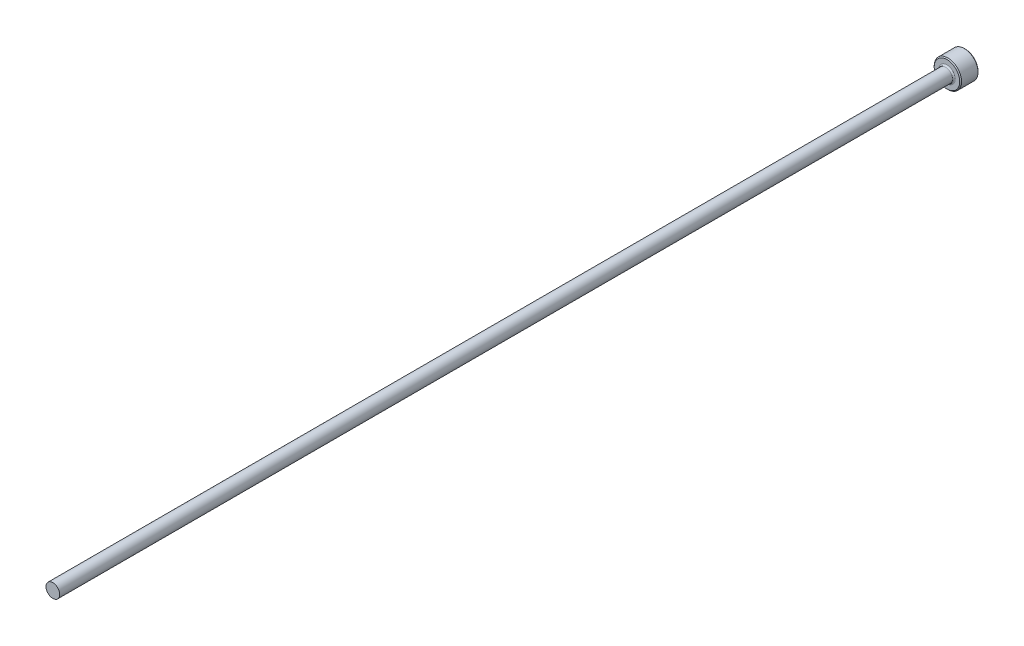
ISO-10303-21;
HEADER;
FILE_DESCRIPTION(('STEP AP214'),'2;1');
FILE_NAME('part.step','',(''),(''),'','','');
FILE_SCHEMA(('AUTOMOTIVE_DESIGN { 1 0 10303 214 1 1 1 1 }'));
ENDSEC;
DATA;
#1=APPLICATION_CONTEXT('core data for automotive mechanical design processes');
#2=APPLICATION_PROTOCOL_DEFINITION('international standard','automotive_design',2000,#1);
#3=PRODUCT_CONTEXT('',#1,'mechanical');
#4=PRODUCT('Part','Part','',(#3));
#5=PRODUCT_RELATED_PRODUCT_CATEGORY('part','',(#4));
#6=PRODUCT_DEFINITION_FORMATION('','',#4);
#7=PRODUCT_DEFINITION_CONTEXT('part definition',#1,'design');
#8=PRODUCT_DEFINITION('design','',#6,#7);
#9=PRODUCT_DEFINITION_SHAPE('','',#8);
#10=(LENGTH_UNIT() NAMED_UNIT(*) SI_UNIT(.MILLI.,.METRE.));
#11=(NAMED_UNIT(*) PLANE_ANGLE_UNIT() SI_UNIT($,.RADIAN.));
#12=(NAMED_UNIT(*) SI_UNIT($,.STERADIAN.) SOLID_ANGLE_UNIT());
#13=UNCERTAINTY_MEASURE_WITH_UNIT(LENGTH_MEASURE(1.E-05),#10,'distance_accuracy_value','');
#14=(GEOMETRIC_REPRESENTATION_CONTEXT(3) GLOBAL_UNCERTAINTY_ASSIGNED_CONTEXT((#13)) GLOBAL_UNIT_ASSIGNED_CONTEXT((#10,
#11,#12)) REPRESENTATION_CONTEXT('',''));
#15=CARTESIAN_POINT('',(0.,0.,0.));
#16=DIRECTION('',(0.,0.,1.));
#17=DIRECTION('',(1.,0.,0.));
#18=AXIS2_PLACEMENT_3D('',#15,#16,#17);
#19=CARTESIAN_POINT('',(0.,1.49999999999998,200.));
#20=DIRECTION('',(0.,0.,-1.));
#21=DIRECTION('',(-1.,0.,0.));
#22=AXIS2_PLACEMENT_3D('',#19,#20,#21);
#23=PLANE('',#22);
#24=CARTESIAN_POINT('',(0.,0.,200.));
#25=DIRECTION('',(0.,0.,1.));
#26=DIRECTION('',(1.,0.,0.));
#27=AXIS2_PLACEMENT_3D('',#24,#25,#26);
#28=CIRCLE('',#27,1.49999999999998);
#29=CARTESIAN_POINT('',(1.49999999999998,0.,200.));
#30=VERTEX_POINT('',#29);
#31=EDGE_CURVE('E50',#30,#30,#28,.T.);
#32=ORIENTED_EDGE('',*,*,#31,.T.);
#33=EDGE_LOOP('',(#32));
#34=FACE_BOUND('',#33,.T.);
#35=ADVANCED_FACE('F30',(#34),#23,.F.);
#36=CARTESIAN_POINT('',(0.,0.,109.050628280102));
#37=DIRECTION('',(0.,0.,1.));
#38=DIRECTION('',(1.,0.,0.));
#39=AXIS2_PLACEMENT_3D('',#36,#37,#38);
#40=CYLINDRICAL_SURFACE('',#39,1.49999999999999);
#41=ORIENTED_EDGE('',*,*,#31,.F.);
#42=EDGE_LOOP('',(#41));
#43=FACE_BOUND('',#42,.T.);
#44=CARTESIAN_POINT('',(0.,0.,4.3));
#45=DIRECTION('',(0.,0.,1.));
#46=DIRECTION('',(1.,0.,0.));
#47=AXIS2_PLACEMENT_3D('',#44,#45,#46);
#48=CIRCLE('',#47,1.5);
#49=CARTESIAN_POINT('',(1.5,0.,4.3));
#50=VERTEX_POINT('',#49);
#51=EDGE_CURVE('E53',#50,#50,#48,.T.);
#52=ORIENTED_EDGE('',*,*,#51,.T.);
#53=EDGE_LOOP('',(#52));
#54=FACE_BOUND('',#53,.T.);
#55=ADVANCED_FACE('F73',(#43,#54),#40,.T.);
#56=CARTESIAN_POINT('',(0.,0.,4.3));
#57=DIRECTION('',(0.,0.,1.));
#58=DIRECTION('',(1.,0.,0.));
#59=AXIS2_PLACEMENT_3D('',#56,#57,#58);
#60=TOROIDAL_SURFACE('',#59,1.8,0.3);
#61=ORIENTED_EDGE('',*,*,#51,.F.);
#62=EDGE_LOOP('',(#61));
#63=FACE_BOUND('',#62,.T.);
#64=CARTESIAN_POINT('',(0.,0.,4.));
#65=DIRECTION('',(0.,0.,1.));
#66=DIRECTION('',(1.,0.,0.));
#67=AXIS2_PLACEMENT_3D('',#64,#65,#66);
#68=CIRCLE('',#67,1.8);
#69=CARTESIAN_POINT('',(1.8,0.,4.));
#70=VERTEX_POINT('',#69);
#71=EDGE_CURVE('E56',#70,#70,#68,.T.);
#72=ORIENTED_EDGE('',*,*,#71,.T.);
#73=EDGE_LOOP('',(#72));
#74=FACE_BOUND('',#73,.T.);
#75=ADVANCED_FACE('F60',(#63,#74),#60,.F.);
#76=CARTESIAN_POINT('',(0.,3.,4.));
#77=DIRECTION('',(0.,0.,-1.));
#78=DIRECTION('',(-1.,0.,0.));
#79=AXIS2_PLACEMENT_3D('',#76,#77,#78);
#80=PLANE('',#79);
#81=CARTESIAN_POINT('',(0.,0.,4.));
#82=DIRECTION('',(0.,0.,-1.));
#83=DIRECTION('',(-1.,0.,0.));
#84=AXIS2_PLACEMENT_3D('',#81,#82,#83);
#85=CIRCLE('',#84,2.80000000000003);
#86=CARTESIAN_POINT('',(-2.80000000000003,0.,4.));
#87=VERTEX_POINT('',#86);
#88=EDGE_CURVE('E10',#87,#87,#85,.F.);
#89=ORIENTED_EDGE('',*,*,#88,.T.);
#90=EDGE_LOOP('',(#89));
#91=FACE_BOUND('',#90,.T.);
#92=ORIENTED_EDGE('',*,*,#71,.F.);
#93=EDGE_LOOP('',(#92));
#94=FACE_BOUND('',#93,.T.);
#95=ADVANCED_FACE('F62',(#91,#94),#80,.F.);
#96=CARTESIAN_POINT('',(0.,0.,109.050628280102));
#97=DIRECTION('',(0.,0.,1.));
#98=DIRECTION('',(1.,0.,0.));
#99=AXIS2_PLACEMENT_3D('',#96,#97,#98);
#100=CYLINDRICAL_SURFACE('',#99,3.);
#101=CARTESIAN_POINT('',(0.,0.,0.199999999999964));
#102=DIRECTION('',(0.,0.,1.));
#103=DIRECTION('',(1.,0.,0.));
#104=AXIS2_PLACEMENT_3D('',#101,#102,#103);
#105=CIRCLE('',#104,3.);
#106=CARTESIAN_POINT('',(3.,0.,0.199999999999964));
#107=VERTEX_POINT('',#106);
#108=EDGE_CURVE('E41',#107,#107,#105,.T.);
#109=ORIENTED_EDGE('',*,*,#108,.T.);
#110=EDGE_LOOP('',(#109));
#111=FACE_BOUND('',#110,.T.);
#112=CARTESIAN_POINT('',(0.,0.,3.80000000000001));
#113=DIRECTION('',(0.,0.,-1.));
#114=DIRECTION('',(-1.,0.,0.));
#115=AXIS2_PLACEMENT_3D('',#112,#113,#114);
#116=CIRCLE('',#115,3.);
#117=CARTESIAN_POINT('',(-3.,0.,3.80000000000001));
#118=VERTEX_POINT('',#117);
#119=EDGE_CURVE('E45',#118,#118,#116,.T.);
#120=ORIENTED_EDGE('',*,*,#119,.T.);
#121=EDGE_LOOP('',(#120));
#122=FACE_BOUND('',#121,.T.);
#123=ADVANCED_FACE('F64',(#111,#122),#100,.T.);
#124=CARTESIAN_POINT('',(0.,0.,0.));
#125=DIRECTION('',(0.,0.,1.));
#126=DIRECTION('',(1.,0.,0.));
#127=AXIS2_PLACEMENT_3D('',#124,#125,#126);
#128=PLANE('',#127);
#129=CARTESIAN_POINT('',(0.,0.,0.));
#130=DIRECTION('',(0.,0.,1.));
#131=DIRECTION('',(1.,0.,0.));
#132=AXIS2_PLACEMENT_3D('',#129,#130,#131);
#133=CIRCLE('',#132,2.80000000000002);
#134=CARTESIAN_POINT('',(2.80000000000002,0.,0.));
#135=VERTEX_POINT('',#134);
#136=EDGE_CURVE('E37',#135,#135,#133,.F.);
#137=ORIENTED_EDGE('',*,*,#136,.T.);
#138=EDGE_LOOP('',(#137));
#139=FACE_BOUND('',#138,.T.);
#140=ADVANCED_FACE('F70',(#139),#128,.F.);
#141=CARTESIAN_POINT('',(0.,0.,0.199999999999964));
#142=DIRECTION('',(0.,0.,1.));
#143=DIRECTION('',(1.,0.,0.));
#144=AXIS2_PLACEMENT_3D('',#141,#142,#143);
#145=CONICAL_SURFACE('',#144,3.,0.785398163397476);
#146=ORIENTED_EDGE('',*,*,#136,.F.);
#147=EDGE_LOOP('',(#146));
#148=FACE_BOUND('',#147,.T.);
#149=ORIENTED_EDGE('',*,*,#108,.F.);
#150=EDGE_LOOP('',(#149));
#151=FACE_BOUND('',#150,.T.);
#152=ADVANCED_FACE('F84',(#148,#151),#145,.T.);
#153=CARTESIAN_POINT('',(0.,0.,4.));
#154=DIRECTION('',(0.,0.,-1.));
#155=DIRECTION('',(-1.,0.,0.));
#156=AXIS2_PLACEMENT_3D('',#153,#154,#155);
#157=CONICAL_SURFACE('',#156,2.80000000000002,0.785398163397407);
#158=ORIENTED_EDGE('',*,*,#119,.F.);
#159=EDGE_LOOP('',(#158));
#160=FACE_BOUND('',#159,.T.);
#161=ORIENTED_EDGE('',*,*,#88,.F.);
#162=EDGE_LOOP('',(#161));
#163=FACE_BOUND('',#162,.T.);
#164=ADVANCED_FACE('F32',(#160,#163),#157,.T.);
#165=CLOSED_SHELL('',(#35,#55,#75,#95,#123,#140,#152,#164));
#166=MANIFOLD_SOLID_BREP('B2',#165);
#167=ADVANCED_BREP_SHAPE_REPRESENTATION('',(#18,#166),#14);
#168=SHAPE_DEFINITION_REPRESENTATION(#9,#167);
ENDSEC;
END-ISO-10303-21;
